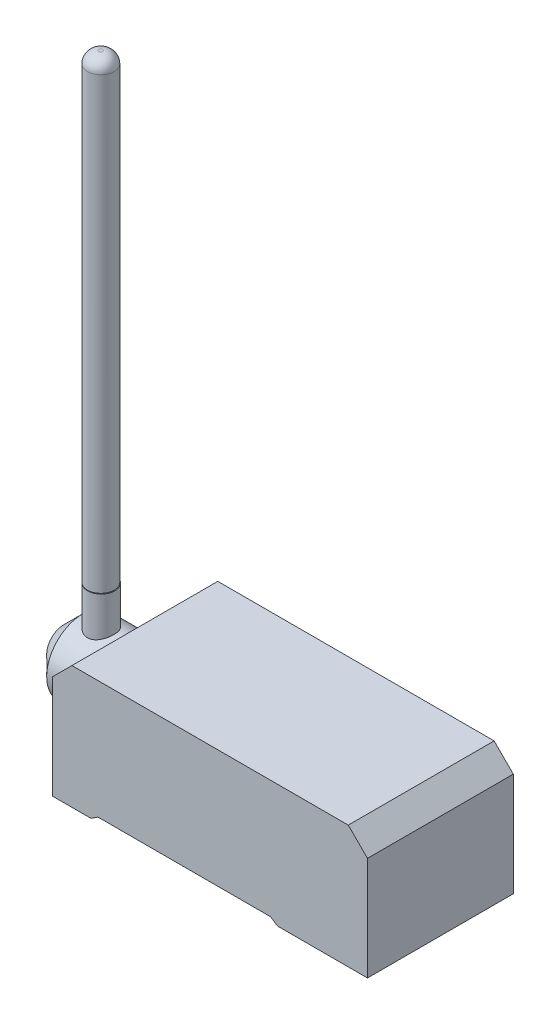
ISO-10303-21;
HEADER;
FILE_DESCRIPTION(('STEP AP214'),'2;1');
FILE_NAME('part.step','',(''),(''),'','','');
FILE_SCHEMA(('AUTOMOTIVE_DESIGN { 1 0 10303 214 1 1 1 1 }'));
ENDSEC;
DATA;
#1=APPLICATION_CONTEXT('core data for automotive mechanical design processes');
#2=APPLICATION_PROTOCOL_DEFINITION('international standard','automotive_design',2000,#1);
#3=PRODUCT_CONTEXT('',#1,'mechanical');
#4=PRODUCT('Part','Part','',(#3));
#5=PRODUCT_RELATED_PRODUCT_CATEGORY('part','',(#4));
#6=PRODUCT_DEFINITION_FORMATION('','',#4);
#7=PRODUCT_DEFINITION_CONTEXT('part definition',#1,'design');
#8=PRODUCT_DEFINITION('design','',#6,#7);
#9=PRODUCT_DEFINITION_SHAPE('','',#8);
#10=(LENGTH_UNIT() NAMED_UNIT(*) SI_UNIT(.MILLI.,.METRE.));
#11=(NAMED_UNIT(*) PLANE_ANGLE_UNIT() SI_UNIT($,.RADIAN.));
#12=(NAMED_UNIT(*) SI_UNIT($,.STERADIAN.) SOLID_ANGLE_UNIT());
#13=UNCERTAINTY_MEASURE_WITH_UNIT(LENGTH_MEASURE(1.E-05),#10,'distance_accuracy_value','');
#14=(GEOMETRIC_REPRESENTATION_CONTEXT(3) GLOBAL_UNCERTAINTY_ASSIGNED_CONTEXT((#13)) GLOBAL_UNIT_ASSIGNED_CONTEXT((#10,
#11,#12)) REPRESENTATION_CONTEXT('',''));
#15=CARTESIAN_POINT('',(0.,0.,0.));
#16=DIRECTION('',(0.,0.,1.));
#17=DIRECTION('',(1.,0.,0.));
#18=AXIS2_PLACEMENT_3D('',#15,#16,#17);
#19=CARTESIAN_POINT('',(-64.4409191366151,19.2415770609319,15.5543735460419));
#20=DIRECTION('',(0.,-1.,0.));
#21=DIRECTION('',(1.,0.,0.));
#22=AXIS2_PLACEMENT_3D('',#19,#20,#21);
#23=PLANE('',#22);
#24=CARTESIAN_POINT('',(-64.6326856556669,19.2415770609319,15.4651710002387));
#25=DIRECTION('',(0.,1.,0.));
#26=DIRECTION('',(-1.,0.,0.));
#27=AXIS2_PLACEMENT_3D('',#24,#25,#26);
#28=CIRCLE('',#27,3.50000000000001);
#29=CARTESIAN_POINT('',(-66.8324167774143,19.2415770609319,18.1875198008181));
#30=VERTEX_POINT('',#29);
#31=CARTESIAN_POINT('',(-63.967672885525,19.2415770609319,12.0289291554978));
#32=VERTEX_POINT('',#31);
#33=EDGE_CURVE('E45',#30,#32,#28,.T.);
#34=ORIENTED_EDGE('',*,*,#33,.F.);
#35=CARTESIAN_POINT('',(-64.4409191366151,19.2415770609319,15.5543735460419));
#36=DIRECTION('',(0.,-1.,0.));
#37=DIRECTION('',(1.,0.,0.));
#38=AXIS2_PLACEMENT_3D('',#35,#36,#37);
#39=CIRCLE('',#38,3.5570662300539);
#40=EDGE_CURVE('E119',#32,#30,#39,.T.);
#41=ORIENTED_EDGE('',*,*,#40,.F.);
#42=EDGE_LOOP('',(#34,#41));
#43=FACE_BOUND('',#42,.T.);
#44=ADVANCED_FACE('F31',(#43),#23,.F.);
#45=CARTESIAN_POINT('',(-74.6219982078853,0.0577763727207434,15.12317535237));
#46=DIRECTION('',(1.,0.,0.));
#47=DIRECTION('',(0.,1.,0.));
#48=AXIS2_PLACEMENT_3D('',#45,#46,#47);
#49=CYLINDRICAL_SURFACE('',#48,9.45851296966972);
#50=CARTESIAN_POINT('',(-54.6219982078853,0.0577763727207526,15.12317535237));
#51=DIRECTION('',(1.,0.,0.));
#52=DIRECTION('',(0.,0.,-1.));
#53=AXIS2_PLACEMENT_3D('',#50,#51,#52);
#54=CIRCLE('',#53,9.45851296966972);
#55=CARTESIAN_POINT('',(-54.6219982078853,0.0577763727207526,5.66466238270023));
#56=VERTEX_POINT('',#55);
#57=EDGE_CURVE('E199',#56,#56,#54,.F.);
#58=ORIENTED_EDGE('',*,*,#57,.T.);
#59=EDGE_LOOP('',(#58));
#60=FACE_BOUND('',#59,.T.);
#61=CARTESIAN_POINT('',(-69.6219982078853,0.0577763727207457,15.12317535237));
#62=DIRECTION('',(-1.,0.,0.));
#63=DIRECTION('',(0.,-1.,0.));
#64=AXIS2_PLACEMENT_3D('',#61,#62,#63);
#65=CIRCLE('',#64,9.45851296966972);
#66=CARTESIAN_POINT('',(-69.6219982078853,-9.40073659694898,15.12317535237));
#67=VERTEX_POINT('',#66);
#68=EDGE_CURVE('E205',#67,#67,#65,.F.);
#69=ORIENTED_EDGE('',*,*,#68,.T.);
#70=EDGE_LOOP('',(#69));
#71=FACE_BOUND('',#70,.T.);
#72=CARTESIAN_POINT('',(-67.9717530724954,9.51628934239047,15.12317535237));
#73=CARTESIAN_POINT('',(-67.9833467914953,9.51628971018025,15.2181051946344));
#74=CARTESIAN_POINT('',(-67.991107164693,9.51485710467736,15.313495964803));
#75=CARTESIAN_POINT('',(-67.9989211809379,9.50908133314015,15.5045372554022));
#76=CARTESIAN_POINT('',(-67.9989723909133,9.50473724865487,15.6001878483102));
#77=CARTESIAN_POINT('',(-67.9913914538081,9.49317052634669,15.7909505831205));
#78=CARTESIAN_POINT('',(-67.9837642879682,9.48594975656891,15.886063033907));
#79=CARTESIAN_POINT('',(-67.9609493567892,9.4687422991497,16.0751347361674));
#80=CARTESIAN_POINT('',(-67.9457587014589,9.45875455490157,16.1690935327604));
#81=CARTESIAN_POINT('',(-67.889140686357,9.42492769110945,16.4478550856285));
#82=CARTESIAN_POINT('',(-67.8366450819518,9.39719177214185,16.6300706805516));
#83=CARTESIAN_POINT('',(-67.7041389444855,9.33346716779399,16.9825378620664));
#84=CARTESIAN_POINT('',(-67.6241208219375,9.2974762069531,17.1527861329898));
#85=CARTESIAN_POINT('',(-67.4356828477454,9.21867985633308,17.4835193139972));
#86=CARTESIAN_POINT('',(-67.3263479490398,9.17567648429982,17.6434357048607));
#87=CARTESIAN_POINT('',(-67.0835795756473,9.08748424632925,17.9431579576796));
#88=CARTESIAN_POINT('',(-66.9501362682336,9.04229449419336,18.0829555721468));
#89=CARTESIAN_POINT('',(-66.6536535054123,8.95112770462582,18.346898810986));
#90=CARTESIAN_POINT('',(-66.489341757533,8.90525849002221,18.4696558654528));
#91=CARTESIAN_POINT('',(-66.140598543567,8.82046807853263,18.6857937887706));
#92=CARTESIAN_POINT('',(-65.956169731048,8.78154596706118,18.7791785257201));
#93=CARTESIAN_POINT('',(-65.6704355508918,8.73234047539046,18.8937274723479));
#94=CARTESIAN_POINT('',(-65.5747545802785,8.71757998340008,18.9274243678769));
#95=CARTESIAN_POINT('',(-65.3804642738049,8.69133721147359,18.9866128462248));
#96=CARTESIAN_POINT('',(-65.2818563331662,8.67985339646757,19.0121082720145));
#97=CARTESIAN_POINT('',(-65.0825191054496,8.6605700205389,19.0545813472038));
#98=CARTESIAN_POINT('',(-64.9817908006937,8.65276879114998,19.071562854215));
#99=CARTESIAN_POINT('',(-64.7790214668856,8.64112699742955,19.0968078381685));
#100=CARTESIAN_POINT('',(-64.6769805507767,8.63728609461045,19.1050720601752));
#101=CARTESIAN_POINT('',(-64.4813502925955,8.63386311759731,19.1124379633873));
#102=CARTESIAN_POINT('',(-64.3877935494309,8.63394132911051,19.1122705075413));
#103=CARTESIAN_POINT('',(-64.2010180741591,8.63751814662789,19.1045716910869));
#104=CARTESIAN_POINT('',(-64.1077994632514,8.641017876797,19.0970379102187));
#105=CARTESIAN_POINT('',(-63.9224580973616,8.65132951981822,19.0746894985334));
#106=CARTESIAN_POINT('',(-63.8303349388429,8.65814017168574,19.0598776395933));
#107=CARTESIAN_POINT('',(-63.6477925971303,8.67485986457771,19.0231419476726));
#108=CARTESIAN_POINT('',(-63.5573740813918,8.68477009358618,19.0012153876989));
#109=CARTESIAN_POINT('',(-63.2932189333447,8.71827874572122,18.9260928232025));
#110=CARTESIAN_POINT('',(-63.1226729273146,8.74589364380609,18.8630672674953));
#111=CARTESIAN_POINT('',(-62.7944383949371,8.80911843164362,18.7126168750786));
#112=CARTESIAN_POINT('',(-62.6367537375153,8.84473071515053,18.6251847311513));
#113=CARTESIAN_POINT('',(-62.3258133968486,8.92356644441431,18.4207648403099));
#114=CARTESIAN_POINT('',(-62.1737878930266,8.96716129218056,18.3020457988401));
#115=CARTESIAN_POINT('',(-61.8910281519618,9.05574618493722,18.0418877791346));
#116=CARTESIAN_POINT('',(-61.7603031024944,9.10073682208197,17.900439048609));
#117=CARTESIAN_POINT('',(-61.5154106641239,9.19099934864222,17.5880793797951));
#118=CARTESIAN_POINT('',(-61.4028397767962,9.23610473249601,17.4158617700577));
#119=CARTESIAN_POINT('',(-61.2085168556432,9.31914155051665,17.0532336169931));
#120=CARTESIAN_POINT('',(-61.1267589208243,9.35707435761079,16.8628265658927));
#121=CARTESIAN_POINT('',(-60.9989079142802,9.42132540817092,16.4741616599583));
#122=CARTESIAN_POINT('',(-60.9519354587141,9.44792224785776,16.2762408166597));
#123=CARTESIAN_POINT('',(-60.8924280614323,9.48859892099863,15.8740579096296));
#124=CARTESIAN_POINT('',(-60.8798764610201,9.50268480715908,15.6697989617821));
#125=CARTESIAN_POINT('',(-60.8897066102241,9.51700001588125,15.2749995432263));
#126=CARTESIAN_POINT('',(-60.909869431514,9.51807096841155,15.084430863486));
#127=CARTESIAN_POINT('',(-60.9804359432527,9.50909138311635,14.7092693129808));
#128=CARTESIAN_POINT('',(-61.0308381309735,9.4990413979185,14.5246761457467));
#129=CARTESIAN_POINT('',(-61.1593885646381,9.46969825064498,14.1688649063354));
#130=CARTESIAN_POINT('',(-61.2371849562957,9.45052126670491,13.9975093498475));
#131=CARTESIAN_POINT('',(-61.4182877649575,9.40543160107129,13.6698350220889));
#132=CARTESIAN_POINT('',(-61.5216000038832,9.37951738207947,13.5135196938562));
#133=CARTESIAN_POINT('',(-61.7564449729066,9.32261826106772,13.2124818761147));
#134=CARTESIAN_POINT('',(-61.889077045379,9.29145211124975,13.0686512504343));
#135=CARTESIAN_POINT('',(-62.1760511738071,9.22872139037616,12.8046221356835));
#136=CARTESIAN_POINT('',(-62.3303998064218,9.19715670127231,12.6844308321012));
#137=CARTESIAN_POINT('',(-62.6632983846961,9.13631394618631,12.4666909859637));
#138=CARTESIAN_POINT('',(-62.8425358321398,9.10716491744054,12.370153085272));
#139=CARTESIAN_POINT('',(-63.2157587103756,9.05649683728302,12.2087791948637));
#140=CARTESIAN_POINT('',(-63.4097397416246,9.03497552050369,12.143933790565));
#141=CARTESIAN_POINT('',(-63.8009747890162,9.00315941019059,12.0497382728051));
#142=CARTESIAN_POINT('',(-63.9979645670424,8.99255292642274,12.0193999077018));
#143=CARTESIAN_POINT('',(-64.3944984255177,8.98301350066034,11.9920665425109));
#144=CARTESIAN_POINT('',(-64.5940417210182,8.98407705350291,11.9950615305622));
#145=CARTESIAN_POINT('',(-64.9803621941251,8.99739200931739,12.033338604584));
#146=CARTESIAN_POINT('',(-65.1673065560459,9.00913097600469,12.0671420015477));
#147=CARTESIAN_POINT('',(-65.532728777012,9.04152690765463,12.1637391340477));
#148=CARTESIAN_POINT('',(-65.7112053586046,9.06218521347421,12.2265372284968));
#149=CARTESIAN_POINT('',(-66.0584221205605,9.11029393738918,12.3805511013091));
#150=CARTESIAN_POINT('',(-66.226922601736,9.13786238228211,12.4722687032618));
#151=CARTESIAN_POINT('',(-66.5466687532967,9.19626868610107,12.6812169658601));
#152=CARTESIAN_POINT('',(-66.6979101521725,9.22710735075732,12.7984539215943));
#153=CARTESIAN_POINT('',(-66.986892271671,9.29006362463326,13.0621971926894));
#154=CARTESIAN_POINT('',(-67.1235556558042,9.32216654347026,13.2098885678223));
#155=CARTESIAN_POINT('',(-67.370499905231,9.38201022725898,13.526914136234));
#156=CARTESIAN_POINT('',(-67.4807719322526,9.40974952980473,13.6962555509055));
#157=CARTESIAN_POINT('',(-67.6277443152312,9.44628909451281,13.9704285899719));
#158=CARTESIAN_POINT('',(-67.6750287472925,9.45794929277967,14.0693479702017));
#159=CARTESIAN_POINT('',(-67.7603499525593,9.47840131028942,14.2713693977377));
#160=CARTESIAN_POINT('',(-67.7983906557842,9.48719434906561,14.3744696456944));
#161=CARTESIAN_POINT('',(-67.8648097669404,9.50148861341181,14.583926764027));
#162=CARTESIAN_POINT('',(-67.8931904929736,9.50699062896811,14.6902828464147));
#163=CARTESIAN_POINT('',(-67.9399899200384,9.51439050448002,14.9052811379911));
#164=CARTESIAN_POINT('',(-67.9584101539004,9.51628891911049,15.0139229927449));
#165=CARTESIAN_POINT('',(-67.9717530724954,9.51628934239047,15.12317535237));
#166=B_SPLINE_CURVE_WITH_KNOTS('',3,(#72,#73,#74,#75,#76,#77,#78,#79,#80,#81,#82,#83,#84,#85,
#86,#87,#88,#89,#90,#91,#92,#93,#94,#95,#96,#97,#98,#99,#100,#101,#102,#103,#104,#105,#106,#107,
#108,#109,#110,#111,#112,#113,#114,#115,#116,#117,#118,#119,#120,#121,#122,#123,#124,#125,#126,
#127,#128,#129,#130,#131,#132,#133,#134,#135,#136,#137,#138,#139,#140,#141,#142,#143,#144,#145,
#146,#147,#148,#149,#150,#151,#152,#153,#154,#155,#156,#157,#158,#159,#160,#161,#162,#163,#164,
#165),.UNSPECIFIED.,.T.,.F.,(4,2,2,2,2,2,2,2,2,2,2,2,2,2,2,2,2,2,2,2,2,2,2,2,2,2,2,2,2,2,2,2,2,
2,2,2,2,2,2,2,2,2,2,2,2,2,4),(0.,0.286803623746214,0.573697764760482,0.860405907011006,
1.14722368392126,1.71929185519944,2.29151790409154,2.88425033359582,3.47722505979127,
4.1047869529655,4.73226616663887,5.03944780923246,5.34648530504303,5.65338355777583,
5.96025557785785,6.24057768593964,6.52099192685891,6.80129945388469,7.08171454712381,
7.63084998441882,8.18015000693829,8.77086281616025,9.36182975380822,9.9906427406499,
10.6193352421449,11.2315342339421,11.8434368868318,12.4155421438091,12.9876189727,
13.5526009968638,14.117712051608,14.7094198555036,15.3013072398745,15.9152504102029,
16.5290110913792,17.1247128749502,17.7202357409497,18.2885996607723,18.8570490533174,
19.435962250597,20.0150184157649,20.6235147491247,21.2322145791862,21.562560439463,
21.8927656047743,22.2228914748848,22.5529665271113),.UNSPECIFIED.);
#167=CARTESIAN_POINT('',(-67.9717530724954,9.51628934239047,15.12317535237));
#168=VERTEX_POINT('',#167);
#169=EDGE_CURVE('E208',#168,#168,#166,.T.);
#170=ORIENTED_EDGE('',*,*,#169,.F.);
#171=EDGE_LOOP('',(#170));
#172=FACE_BOUND('',#171,.T.);
#173=ADVANCED_FACE('F214',(#60,#71,#172),#49,.T.);
#174=CARTESIAN_POINT('',(-54.6219982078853,19.2415770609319,38.));
#175=DIRECTION('',(1.,0.,0.));
#176=DIRECTION('',(0.,0.,-1.));
#177=AXIS2_PLACEMENT_3D('',#174,#175,#176);
#178=PLANE('',#177);
#179=DIRECTION('',(0.,-1.,0.));
#180=VECTOR('',#179,1.);
#181=CARTESIAN_POINT('',(-54.6219982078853,19.2415770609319,38.));
#182=LINE('',#181,#180);
#183=CARTESIAN_POINT('',(-54.6219982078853,14.2415770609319,38.));
#184=VERTEX_POINT('',#183);
#185=CARTESIAN_POINT('',(-54.6219982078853,-12.7584229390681,38.));
#186=VERTEX_POINT('',#185);
#187=EDGE_CURVE('E146',#184,#186,#182,.T.);
#188=ORIENTED_EDGE('',*,*,#187,.F.);
#189=DIRECTION('',(0.,0.,-1.));
#190=VECTOR('',#189,1.);
#191=CARTESIAN_POINT('',(-54.6219982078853,14.2415770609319,38.));
#192=LINE('',#191,#190);
#193=CARTESIAN_POINT('',(-54.6219982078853,14.2415770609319,0.));
#194=VERTEX_POINT('',#193);
#195=EDGE_CURVE('E180',#184,#194,#192,.T.);
#196=ORIENTED_EDGE('',*,*,#195,.T.);
#197=DIRECTION('',(0.,-1.,0.));
#198=VECTOR('',#197,1.);
#199=CARTESIAN_POINT('',(-54.6219982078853,19.2415770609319,0.));
#200=LINE('',#199,#198);
#201=CARTESIAN_POINT('',(-54.6219982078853,-12.7584229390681,0.));
#202=VERTEX_POINT('',#201);
#203=EDGE_CURVE('E123',#194,#202,#200,.T.);
#204=ORIENTED_EDGE('',*,*,#203,.T.);
#205=DIRECTION('',(0.,0.,-1.));
#206=VECTOR('',#205,1.);
#207=CARTESIAN_POINT('',(-54.6219982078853,-12.7584229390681,38.));
#208=LINE('',#207,#206);
#209=EDGE_CURVE('E177',#186,#202,#208,.T.);
#210=ORIENTED_EDGE('',*,*,#209,.F.);
#211=EDGE_LOOP('',(#188,#196,#204,#210));
#212=FACE_BOUND('',#211,.T.);
#213=ORIENTED_EDGE('',*,*,#57,.F.);
#214=EDGE_LOOP('',(#213));
#215=FACE_BOUND('',#214,.T.);
#216=ADVANCED_FACE('F33',(#212,#215),#178,.F.);
#217=CARTESIAN_POINT('',(-54.6219982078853,-12.7584229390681,38.));
#218=DIRECTION('',(0.,1.,0.));
#219=DIRECTION('',(0.,0.,1.));
#220=AXIS2_PLACEMENT_3D('',#217,#218,#219);
#221=PLANE('',#220);
#222=DIRECTION('',(1.,0.,0.));
#223=VECTOR('',#222,1.);
#224=CARTESIAN_POINT('',(-54.6219982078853,-12.7584229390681,0.));
#225=LINE('',#224,#223);
#226=CARTESIAN_POINT('',(-44.6544802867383,-12.7584229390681,0.));
#227=VERTEX_POINT('',#226);
#228=EDGE_CURVE('E132',#202,#227,#225,.T.);
#229=ORIENTED_EDGE('',*,*,#228,.T.);
#230=DIRECTION('',(0.,0.,-1.));
#231=VECTOR('',#230,1.);
#232=CARTESIAN_POINT('',(-44.6544802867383,-12.7584229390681,38.));
#233=LINE('',#232,#231);
#234=CARTESIAN_POINT('',(-44.6544802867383,-12.7584229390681,38.));
#235=VERTEX_POINT('',#234);
#236=EDGE_CURVE('E174',#235,#227,#233,.T.);
#237=ORIENTED_EDGE('',*,*,#236,.F.);
#238=DIRECTION('',(1.,0.,0.));
#239=VECTOR('',#238,1.);
#240=CARTESIAN_POINT('',(-54.6219982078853,-12.7584229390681,38.));
#241=LINE('',#240,#239);
#242=EDGE_CURVE('E148',#186,#235,#241,.T.);
#243=ORIENTED_EDGE('',*,*,#242,.F.);
#244=ORIENTED_EDGE('',*,*,#209,.T.);
#245=EDGE_LOOP('',(#229,#237,#243,#244));
#246=FACE_BOUND('',#245,.T.);
#247=ADVANCED_FACE('F243',(#246),#221,.F.);
#248=CARTESIAN_POINT('',(-44.6544802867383,-12.7584229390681,38.));
#249=DIRECTION('',(-0.554700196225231,0.832050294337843,0.));
#250=DIRECTION('',(-0.832050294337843,-0.554700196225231,0.));
#251=AXIS2_PLACEMENT_3D('',#248,#249,#250);
#252=PLANE('',#251);
#253=DIRECTION('',(0.832050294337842,0.55470019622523,0.));
#254=VECTOR('',#253,1.);
#255=CARTESIAN_POINT('',(-44.6544802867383,-12.7584229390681,0.));
#256=LINE('',#255,#254);
#257=CARTESIAN_POINT('',(-42.8603270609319,-11.5623207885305,0.));
#258=VERTEX_POINT('',#257);
#259=EDGE_CURVE('E134',#227,#258,#256,.T.);
#260=ORIENTED_EDGE('',*,*,#259,.T.);
#261=DIRECTION('',(0.,0.,-1.));
#262=VECTOR('',#261,1.);
#263=CARTESIAN_POINT('',(-42.8603270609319,-11.5623207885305,38.));
#264=LINE('',#263,#262);
#265=CARTESIAN_POINT('',(-42.8603270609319,-11.5623207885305,38.));
#266=VERTEX_POINT('',#265);
#267=EDGE_CURVE('E171',#266,#258,#264,.T.);
#268=ORIENTED_EDGE('',*,*,#267,.F.);
#269=DIRECTION('',(0.832050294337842,0.55470019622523,0.));
#270=VECTOR('',#269,1.);
#271=CARTESIAN_POINT('',(-44.6544802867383,-12.7584229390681,38.));
#272=LINE('',#271,#270);
#273=EDGE_CURVE('E150',#235,#266,#272,.T.);
#274=ORIENTED_EDGE('',*,*,#273,.F.);
#275=ORIENTED_EDGE('',*,*,#236,.T.);
#276=EDGE_LOOP('',(#260,#268,#274,#275));
#277=FACE_BOUND('',#276,.T.);
#278=ADVANCED_FACE('F256',(#277),#252,.F.);
#279=CARTESIAN_POINT('',(-42.8603270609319,-11.5623207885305,38.));
#280=DIRECTION('',(0.,1.,0.));
#281=DIRECTION('',(0.,0.,1.));
#282=AXIS2_PLACEMENT_3D('',#279,#280,#281);
#283=PLANE('',#282);
#284=DIRECTION('',(1.,0.,0.));
#285=VECTOR('',#284,1.);
#286=CARTESIAN_POINT('',(-42.8603270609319,-11.5623207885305,0.));
#287=LINE('',#286,#285);
#288=CARTESIAN_POINT('',(2.1396729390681,-11.5623207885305,0.));
#289=VERTEX_POINT('',#288);
#290=EDGE_CURVE('E136',#258,#289,#287,.T.);
#291=ORIENTED_EDGE('',*,*,#290,.T.);
#292=DIRECTION('',(0.,0.,-1.));
#293=VECTOR('',#292,1.);
#294=CARTESIAN_POINT('',(2.1396729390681,-11.5623207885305,38.));
#295=LINE('',#294,#293);
#296=CARTESIAN_POINT('',(2.1396729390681,-11.5623207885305,38.));
#297=VERTEX_POINT('',#296);
#298=EDGE_CURVE('E168',#297,#289,#295,.T.);
#299=ORIENTED_EDGE('',*,*,#298,.F.);
#300=DIRECTION('',(1.,0.,0.));
#301=VECTOR('',#300,1.);
#302=CARTESIAN_POINT('',(-42.8603270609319,-11.5623207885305,38.));
#303=LINE('',#302,#301);
#304=EDGE_CURVE('E152',#266,#297,#303,.T.);
#305=ORIENTED_EDGE('',*,*,#304,.F.);
#306=ORIENTED_EDGE('',*,*,#267,.T.);
#307=EDGE_LOOP('',(#291,#299,#305,#306));
#308=FACE_BOUND('',#307,.T.);
#309=ADVANCED_FACE('F281',(#308),#283,.F.);
#310=CARTESIAN_POINT('',(2.1396729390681,-11.5623207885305,38.));
#311=DIRECTION('',(0.554700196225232,0.832050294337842,0.));
#312=DIRECTION('',(-0.832050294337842,0.554700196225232,0.));
#313=AXIS2_PLACEMENT_3D('',#310,#311,#312);
#314=PLANE('',#313);
#315=DIRECTION('',(0.832050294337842,-0.554700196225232,0.));
#316=VECTOR('',#315,1.);
#317=CARTESIAN_POINT('',(2.1396729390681,-11.5623207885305,0.));
#318=LINE('',#317,#316);
#319=CARTESIAN_POINT('',(3.93382616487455,-12.7584229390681,0.));
#320=VERTEX_POINT('',#319);
#321=EDGE_CURVE('E138',#289,#320,#318,.T.);
#322=ORIENTED_EDGE('',*,*,#321,.T.);
#323=DIRECTION('',(0.,0.,-1.));
#324=VECTOR('',#323,1.);
#325=CARTESIAN_POINT('',(3.93382616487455,-12.7584229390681,38.));
#326=LINE('',#325,#324);
#327=CARTESIAN_POINT('',(3.93382616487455,-12.7584229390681,38.));
#328=VERTEX_POINT('',#327);
#329=EDGE_CURVE('E165',#328,#320,#326,.T.);
#330=ORIENTED_EDGE('',*,*,#329,.F.);
#331=DIRECTION('',(0.832050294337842,-0.554700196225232,0.));
#332=VECTOR('',#331,1.);
#333=CARTESIAN_POINT('',(2.1396729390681,-11.5623207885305,38.));
#334=LINE('',#333,#332);
#335=EDGE_CURVE('E154',#297,#328,#334,.T.);
#336=ORIENTED_EDGE('',*,*,#335,.F.);
#337=ORIENTED_EDGE('',*,*,#298,.T.);
#338=EDGE_LOOP('',(#322,#330,#336,#337));
#339=FACE_BOUND('',#338,.T.);
#340=ADVANCED_FACE('F286',(#339),#314,.F.);
#341=CARTESIAN_POINT('',(3.93382616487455,-12.7584229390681,38.));
#342=DIRECTION('',(0.,1.,0.));
#343=DIRECTION('',(0.,0.,1.));
#344=AXIS2_PLACEMENT_3D('',#341,#342,#343);
#345=PLANE('',#344);
#346=DIRECTION('',(1.,0.,0.));
#347=VECTOR('',#346,1.);
#348=CARTESIAN_POINT('',(3.93382616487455,-12.7584229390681,0.));
#349=LINE('',#348,#347);
#350=CARTESIAN_POINT('',(27.3780017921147,-12.7584229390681,0.));
#351=VERTEX_POINT('',#350);
#352=EDGE_CURVE('E140',#320,#351,#349,.T.);
#353=ORIENTED_EDGE('',*,*,#352,.T.);
#354=DIRECTION('',(0.,0.,-1.));
#355=VECTOR('',#354,1.);
#356=CARTESIAN_POINT('',(27.3780017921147,-12.7584229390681,38.));
#357=LINE('',#356,#355);
#358=CARTESIAN_POINT('',(27.3780017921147,-12.7584229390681,38.));
#359=VERTEX_POINT('',#358);
#360=EDGE_CURVE('E162',#359,#351,#357,.T.);
#361=ORIENTED_EDGE('',*,*,#360,.F.);
#362=DIRECTION('',(1.,0.,0.));
#363=VECTOR('',#362,1.);
#364=CARTESIAN_POINT('',(3.93382616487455,-12.7584229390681,38.));
#365=LINE('',#364,#363);
#366=EDGE_CURVE('E156',#328,#359,#365,.T.);
#367=ORIENTED_EDGE('',*,*,#366,.F.);
#368=ORIENTED_EDGE('',*,*,#329,.T.);
#369=EDGE_LOOP('',(#353,#361,#367,#368));
#370=FACE_BOUND('',#369,.T.);
#371=ADVANCED_FACE('F291',(#370),#345,.F.);
#372=CARTESIAN_POINT('',(27.3780017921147,-12.7584229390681,38.));
#373=DIRECTION('',(-1.,0.,0.));
#374=DIRECTION('',(0.,0.,1.));
#375=AXIS2_PLACEMENT_3D('',#372,#373,#374);
#376=PLANE('',#375);
#377=DIRECTION('',(0.,1.,0.));
#378=VECTOR('',#377,1.);
#379=CARTESIAN_POINT('',(27.3780017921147,-12.7584229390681,0.));
#380=LINE('',#379,#378);
#381=CARTESIAN_POINT('',(27.3780017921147,14.2415770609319,0.));
#382=VERTEX_POINT('',#381);
#383=EDGE_CURVE('E142',#351,#382,#380,.T.);
#384=ORIENTED_EDGE('',*,*,#383,.T.);
#385=DIRECTION('',(0.,0.,1.));
#386=VECTOR('',#385,1.);
#387=CARTESIAN_POINT('',(27.3780017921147,14.2415770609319,38.));
#388=LINE('',#387,#386);
#389=CARTESIAN_POINT('',(27.3780017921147,14.2415770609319,38.));
#390=VERTEX_POINT('',#389);
#391=EDGE_CURVE('E53',#382,#390,#388,.T.);
#392=ORIENTED_EDGE('',*,*,#391,.T.);
#393=DIRECTION('',(0.,1.,0.));
#394=VECTOR('',#393,1.);
#395=CARTESIAN_POINT('',(27.3780017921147,-12.7584229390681,38.));
#396=LINE('',#395,#394);
#397=EDGE_CURVE('E158',#359,#390,#396,.T.);
#398=ORIENTED_EDGE('',*,*,#397,.F.);
#399=ORIENTED_EDGE('',*,*,#360,.T.);
#400=EDGE_LOOP('',(#384,#392,#398,#399));
#401=FACE_BOUND('',#400,.T.);
#402=ADVANCED_FACE('F294',(#401),#376,.F.);
#403=CARTESIAN_POINT('',(27.3780017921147,19.2415770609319,38.));
#404=DIRECTION('',(0.,-1.,0.));
#405=DIRECTION('',(1.,0.,0.));
#406=AXIS2_PLACEMENT_3D('',#403,#404,#405);
#407=PLANE('',#406);
#408=DIRECTION('',(-1.,0.,0.));
#409=VECTOR('',#408,1.);
#410=CARTESIAN_POINT('',(27.3780017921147,19.2415770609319,38.));
#411=LINE('',#410,#409);
#412=CARTESIAN_POINT('',(22.3780017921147,19.2415770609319,38.));
#413=VERTEX_POINT('',#412);
#414=CARTESIAN_POINT('',(-49.6219982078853,19.2415770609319,38.));
#415=VERTEX_POINT('',#414);
#416=EDGE_CURVE('E160',#413,#415,#411,.T.);
#417=ORIENTED_EDGE('',*,*,#416,.F.);
#418=DIRECTION('',(0.,0.,-1.));
#419=VECTOR('',#418,1.);
#420=CARTESIAN_POINT('',(22.3780017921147,19.2415770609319,38.));
#421=LINE('',#420,#419);
#422=CARTESIAN_POINT('',(22.3780017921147,19.2415770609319,0.));
#423=VERTEX_POINT('',#422);
#424=EDGE_CURVE('E191',#413,#423,#421,.T.);
#425=ORIENTED_EDGE('',*,*,#424,.T.);
#426=DIRECTION('',(-1.,0.,0.));
#427=VECTOR('',#426,1.);
#428=CARTESIAN_POINT('',(27.3780017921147,19.2415770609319,0.));
#429=LINE('',#428,#427);
#430=CARTESIAN_POINT('',(-49.6219982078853,19.2415770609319,0.));
#431=VERTEX_POINT('',#430);
#432=EDGE_CURVE('E144',#423,#431,#429,.T.);
#433=ORIENTED_EDGE('',*,*,#432,.T.);
#434=DIRECTION('',(0.,0.,1.));
#435=VECTOR('',#434,1.);
#436=CARTESIAN_POINT('',(-49.6219982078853,19.2415770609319,38.));
#437=LINE('',#436,#435);
#438=EDGE_CURVE('E186',#431,#415,#437,.T.);
#439=ORIENTED_EDGE('',*,*,#438,.T.);
#440=EDGE_LOOP('',(#417,#425,#433,#439));
#441=FACE_BOUND('',#440,.T.);
#442=ADVANCED_FACE('F296',(#441),#407,.F.);
#443=CARTESIAN_POINT('',(-54.6219982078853,-12.7584229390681,38.));
#444=DIRECTION('',(0.,0.,1.));
#445=DIRECTION('',(1.,0.,0.));
#446=AXIS2_PLACEMENT_3D('',#443,#444,#445);
#447=PLANE('',#446);
#448=ORIENTED_EDGE('',*,*,#397,.T.);
#449=DIRECTION('',(0.707106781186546,-0.707106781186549,0.));
#450=VECTOR('',#449,1.);
#451=CARTESIAN_POINT('',(-0.121998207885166,41.7415770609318,38.));
#452=LINE('',#451,#450);
#453=EDGE_CURVE('E197',#390,#413,#452,.F.);
#454=ORIENTED_EDGE('',*,*,#453,.T.);
#455=ORIENTED_EDGE('',*,*,#416,.T.);
#456=DIRECTION('',(0.707106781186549,0.707106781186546,0.));
#457=VECTOR('',#456,1.);
#458=CARTESIAN_POINT('',(-68.1219982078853,0.741577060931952,38.));
#459=LINE('',#458,#457);
#460=EDGE_CURVE('E189',#415,#184,#459,.F.);
#461=ORIENTED_EDGE('',*,*,#460,.T.);
#462=ORIENTED_EDGE('',*,*,#187,.T.);
#463=ORIENTED_EDGE('',*,*,#242,.T.);
#464=ORIENTED_EDGE('',*,*,#273,.T.);
#465=ORIENTED_EDGE('',*,*,#304,.T.);
#466=ORIENTED_EDGE('',*,*,#335,.T.);
#467=ORIENTED_EDGE('',*,*,#366,.T.);
#468=EDGE_LOOP('',(#448,#454,#455,#461,#462,#463,#464,#465,#466,#467));
#469=FACE_BOUND('',#468,.T.);
#470=ADVANCED_FACE('F275',(#469),#447,.T.);
#471=CARTESIAN_POINT('',(-54.6219982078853,-12.7584229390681,0.));
#472=DIRECTION('',(0.,0.,1.));
#473=DIRECTION('',(1.,0.,0.));
#474=AXIS2_PLACEMENT_3D('',#471,#472,#473);
#475=PLANE('',#474);
#476=ORIENTED_EDGE('',*,*,#432,.F.);
#477=DIRECTION('',(-0.707106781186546,0.707106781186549,0.));
#478=VECTOR('',#477,1.);
#479=CARTESIAN_POINT('',(22.3780017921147,19.2415770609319,0.));
#480=LINE('',#479,#478);
#481=EDGE_CURVE('E194',#423,#382,#480,.F.);
#482=ORIENTED_EDGE('',*,*,#481,.T.);
#483=ORIENTED_EDGE('',*,*,#383,.F.);
#484=ORIENTED_EDGE('',*,*,#352,.F.);
#485=ORIENTED_EDGE('',*,*,#321,.F.);
#486=ORIENTED_EDGE('',*,*,#290,.F.);
#487=ORIENTED_EDGE('',*,*,#259,.F.);
#488=ORIENTED_EDGE('',*,*,#228,.F.);
#489=ORIENTED_EDGE('',*,*,#203,.F.);
#490=DIRECTION('',(-0.707106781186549,-0.707106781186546,0.));
#491=VECTOR('',#490,1.);
#492=CARTESIAN_POINT('',(-54.6219982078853,14.2415770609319,0.));
#493=LINE('',#492,#491);
#494=EDGE_CURVE('E183',#194,#431,#493,.F.);
#495=ORIENTED_EDGE('',*,*,#494,.T.);
#496=EDGE_LOOP('',(#476,#482,#483,#484,#485,#486,#487,#488,#489,#495));
#497=FACE_BOUND('',#496,.T.);
#498=ADVANCED_FACE('F269',(#497),#475,.F.);
#499=CARTESIAN_POINT('',(-54.6219982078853,14.2415770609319,38.));
#500=DIRECTION('',(0.707106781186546,-0.707106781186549,0.));
#501=DIRECTION('',(0.707106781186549,0.707106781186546,0.));
#502=AXIS2_PLACEMENT_3D('',#499,#500,#501);
#503=PLANE('',#502);
#504=ORIENTED_EDGE('',*,*,#460,.F.);
#505=ORIENTED_EDGE('',*,*,#438,.F.);
#506=ORIENTED_EDGE('',*,*,#494,.F.);
#507=ORIENTED_EDGE('',*,*,#195,.F.);
#508=EDGE_LOOP('',(#504,#505,#506,#507));
#509=FACE_BOUND('',#508,.T.);
#510=ADVANCED_FACE('F233',(#509),#503,.F.);
#511=CARTESIAN_POINT('',(22.3780017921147,19.2415770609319,38.));
#512=DIRECTION('',(-0.707106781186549,-0.707106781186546,0.));
#513=DIRECTION('',(0.707106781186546,-0.707106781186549,0.));
#514=AXIS2_PLACEMENT_3D('',#511,#512,#513);
#515=PLANE('',#514);
#516=ORIENTED_EDGE('',*,*,#453,.F.);
#517=ORIENTED_EDGE('',*,*,#391,.F.);
#518=ORIENTED_EDGE('',*,*,#481,.F.);
#519=ORIENTED_EDGE('',*,*,#424,.F.);
#520=EDGE_LOOP('',(#516,#517,#518,#519));
#521=FACE_BOUND('',#520,.T.);
#522=ADVANCED_FACE('F228',(#521),#515,.F.);
#523=CARTESIAN_POINT('',(-74.6219982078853,0.0577763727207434,15.12317535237));
#524=DIRECTION('',(-1.,0.,0.));
#525=DIRECTION('',(0.,-1.,0.));
#526=AXIS2_PLACEMENT_3D('',#523,#524,#525);
#527=PLANE('',#526);
#528=CARTESIAN_POINT('',(-74.6219982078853,0.0577763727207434,15.12317535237));
#529=DIRECTION('',(-1.,0.,0.));
#530=DIRECTION('',(0.,-1.,0.));
#531=AXIS2_PLACEMENT_3D('',#528,#529,#530);
#532=CIRCLE('',#531,4.45851296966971);
#533=CARTESIAN_POINT('',(-74.6219982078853,-4.40073659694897,15.12317535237));
#534=VERTEX_POINT('',#533);
#535=EDGE_CURVE('E202',#534,#534,#532,.T.);
#536=ORIENTED_EDGE('',*,*,#535,.T.);
#537=EDGE_LOOP('',(#536));
#538=FACE_BOUND('',#537,.T.);
#539=ADVANCED_FACE('F225',(#538),#527,.T.);
#540=CARTESIAN_POINT('',(-74.6219982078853,0.0577763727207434,15.12317535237));
#541=DIRECTION('',(1.,0.,0.));
#542=DIRECTION('',(0.,1.,0.));
#543=AXIS2_PLACEMENT_3D('',#540,#541,#542);
#544=CONICAL_SURFACE('',#543,4.45851296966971,0.785398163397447);
#545=ORIENTED_EDGE('',*,*,#68,.F.);
#546=EDGE_LOOP('',(#545));
#547=FACE_BOUND('',#546,.T.);
#548=ORIENTED_EDGE('',*,*,#535,.F.);
#549=EDGE_LOOP('',(#548));
#550=FACE_BOUND('',#549,.T.);
#551=ADVANCED_FACE('F222',(#547,#550),#544,.T.);
#552=CARTESIAN_POINT('',(-64.4409191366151,-0.758422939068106,15.5543735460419));
#553=DIRECTION('',(0.,1.,0.));
#554=DIRECTION('',(-1.,0.,0.));
#555=AXIS2_PLACEMENT_3D('',#552,#553,#554);
#556=CYLINDRICAL_SURFACE('',#555,3.5570662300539);
#557=EDGE_CURVE('E116',#30,#32,#39,.T.);
#558=ORIENTED_EDGE('',*,*,#557,.T.);
#559=ORIENTED_EDGE('',*,*,#40,.T.);
#560=EDGE_LOOP('',(#558,#559));
#561=FACE_BOUND('',#560,.T.);
#562=ORIENTED_EDGE('',*,*,#169,.T.);
#563=EDGE_LOOP('',(#562));
#564=FACE_BOUND('',#563,.T.);
#565=ADVANCED_FACE('F117',(#561,#564),#556,.T.);
#566=CARTESIAN_POINT('',(-64.6326856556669,139.241577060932,15.4651710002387));
#567=DIRECTION('',(0.,-1.,0.));
#568=DIRECTION('',(1.,0.,0.));
#569=AXIS2_PLACEMENT_3D('',#566,#567,#568);
#570=CYLINDRICAL_SURFACE('',#569,3.50000000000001);
#571=CARTESIAN_POINT('',(-64.6326856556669,136.241577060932,15.4651710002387));
#572=DIRECTION('',(0.,1.,0.));
#573=DIRECTION('',(-1.,0.,0.));
#574=AXIS2_PLACEMENT_3D('',#571,#572,#573);
#575=CIRCLE('',#574,3.50000000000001);
#576=CARTESIAN_POINT('',(-68.1326856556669,136.241577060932,15.4651710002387));
#577=VERTEX_POINT('',#576);
#578=EDGE_CURVE('E11',#577,#577,#575,.F.);
#579=ORIENTED_EDGE('',*,*,#578,.T.);
#580=EDGE_LOOP('',(#579));
#581=FACE_BOUND('',#580,.T.);
#582=ORIENTED_EDGE('',*,*,#33,.T.);
#583=EDGE_CURVE('E125',#32,#30,#28,.T.);
#584=ORIENTED_EDGE('',*,*,#583,.T.);
#585=EDGE_LOOP('',(#582,#584));
#586=FACE_BOUND('',#585,.T.);
#587=ADVANCED_FACE('F129',(#581,#586),#570,.T.);
#588=CARTESIAN_POINT('',(-64.6326856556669,139.241577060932,15.4651710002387));
#589=DIRECTION('',(0.,1.,0.));
#590=DIRECTION('',(-1.,0.,0.));
#591=AXIS2_PLACEMENT_3D('',#588,#589,#590);
#592=PLANE('',#591);
#593=CARTESIAN_POINT('',(-64.6326856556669,139.241577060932,15.4651710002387));
#594=DIRECTION('',(0.,1.,0.));
#595=DIRECTION('',(-1.,0.,0.));
#596=AXIS2_PLACEMENT_3D('',#593,#594,#595);
#597=CIRCLE('',#596,0.500000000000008);
#598=CARTESIAN_POINT('',(-65.132685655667,139.241577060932,15.4651710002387));
#599=VERTEX_POINT('',#598);
#600=EDGE_CURVE('E39',#599,#599,#597,.T.);
#601=ORIENTED_EDGE('',*,*,#600,.T.);
#602=EDGE_LOOP('',(#601));
#603=FACE_BOUND('',#602,.T.);
#604=ADVANCED_FACE('F408',(#603),#592,.T.);
#605=CARTESIAN_POINT('',(-64.6326856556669,19.2415770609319,15.4651710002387));
#606=DIRECTION('',(0.,1.,0.));
#607=DIRECTION('',(-1.,0.,0.));
#608=AXIS2_PLACEMENT_3D('',#605,#606,#607);
#609=PLANE('',#608);
#610=ORIENTED_EDGE('',*,*,#557,.F.);
#611=ORIENTED_EDGE('',*,*,#583,.F.);
#612=EDGE_LOOP('',(#610,#611));
#613=FACE_BOUND('',#612,.T.);
#614=ADVANCED_FACE('F126',(#613),#609,.F.);
#615=CARTESIAN_POINT('',(-64.6326856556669,136.241577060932,15.4651710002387));
#616=DIRECTION('',(0.,1.,0.));
#617=DIRECTION('',(-1.,0.,0.));
#618=AXIS2_PLACEMENT_3D('',#615,#616,#617);
#619=DEGENERATE_TOROIDAL_SURFACE('',#618,0.500000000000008,3.,.T.);
#620=ORIENTED_EDGE('',*,*,#578,.F.);
#621=EDGE_LOOP('',(#620));
#622=FACE_BOUND('',#621,.T.);
#623=ORIENTED_EDGE('',*,*,#600,.F.);
#624=EDGE_LOOP('',(#623));
#625=FACE_BOUND('',#624,.T.);
#626=ADVANCED_FACE('F407',(#622,#625),#619,.T.);
#627=CLOSED_SHELL('',(#44,#173,#216,#247,#278,#309,#340,#371,#402,#442,#470,#498,#510,#522,#539,
#551,#565,#587,#604,#614,#626));
#628=MANIFOLD_SOLID_BREP('B2',#627);
#629=ADVANCED_BREP_SHAPE_REPRESENTATION('',(#18,#628),#14);
#630=SHAPE_DEFINITION_REPRESENTATION(#9,#629);
ENDSEC;
END-ISO-10303-21;
